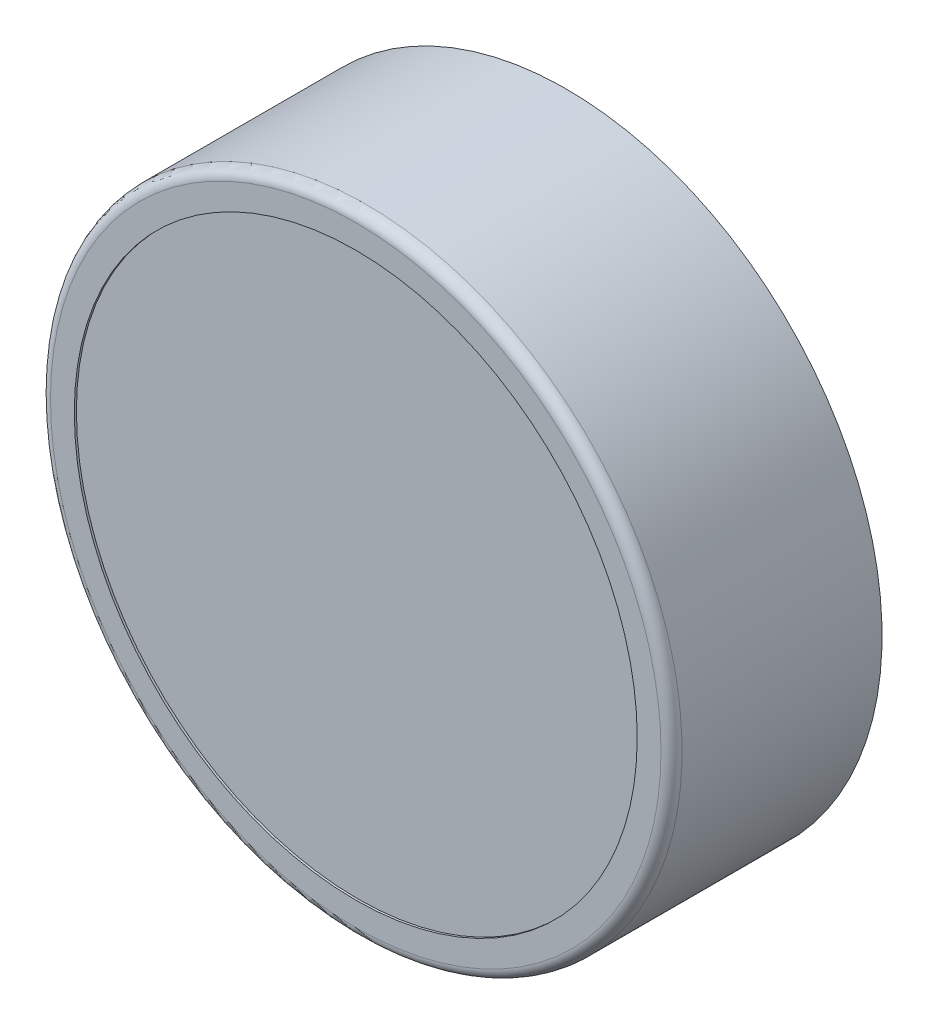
ISO-10303-21;
HEADER;
FILE_DESCRIPTION(('STEP AP214'),'2;1');
FILE_NAME('part.step','',(''),(''),'','','');
FILE_SCHEMA(('AUTOMOTIVE_DESIGN { 1 0 10303 214 1 1 1 1 }'));
ENDSEC;
DATA;
#1=APPLICATION_CONTEXT('core data for automotive mechanical design processes');
#2=APPLICATION_PROTOCOL_DEFINITION('international standard','automotive_design',2000,#1);
#3=PRODUCT_CONTEXT('',#1,'mechanical');
#4=PRODUCT('Part','Part','',(#3));
#5=PRODUCT_RELATED_PRODUCT_CATEGORY('part','',(#4));
#6=PRODUCT_DEFINITION_FORMATION('','',#4);
#7=PRODUCT_DEFINITION_CONTEXT('part definition',#1,'design');
#8=PRODUCT_DEFINITION('design','',#6,#7);
#9=PRODUCT_DEFINITION_SHAPE('','',#8);
#10=(LENGTH_UNIT() NAMED_UNIT(*) SI_UNIT(.MILLI.,.METRE.));
#11=(NAMED_UNIT(*) PLANE_ANGLE_UNIT() SI_UNIT($,.RADIAN.));
#12=(NAMED_UNIT(*) SI_UNIT($,.STERADIAN.) SOLID_ANGLE_UNIT());
#13=UNCERTAINTY_MEASURE_WITH_UNIT(LENGTH_MEASURE(1.E-05),#10,'distance_accuracy_value','');
#14=(GEOMETRIC_REPRESENTATION_CONTEXT(3) GLOBAL_UNCERTAINTY_ASSIGNED_CONTEXT((#13)) GLOBAL_UNIT_ASSIGNED_CONTEXT((#10,
#11,#12)) REPRESENTATION_CONTEXT('',''));
#15=CARTESIAN_POINT('',(0.,0.,0.));
#16=DIRECTION('',(0.,0.,1.));
#17=DIRECTION('',(1.,0.,0.));
#18=AXIS2_PLACEMENT_3D('',#15,#16,#17);
#19=CARTESIAN_POINT('',(0.,0.,9.9));
#20=DIRECTION('',(0.,0.,1.));
#21=DIRECTION('',(1.,0.,0.));
#22=AXIS2_PLACEMENT_3D('',#19,#20,#21);
#23=PLANE('',#22);
#24=CARTESIAN_POINT('',(0.,0.,9.9));
#25=DIRECTION('',(0.,0.,1.));
#26=DIRECTION('',(1.,0.,0.));
#27=AXIS2_PLACEMENT_3D('',#24,#25,#26);
#28=CIRCLE('',#27,13.3691624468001);
#29=CARTESIAN_POINT('',(13.3691624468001,0.,9.9));
#30=VERTEX_POINT('',#29);
#31=EDGE_CURVE('E166',#30,#30,#28,.T.);
#32=ORIENTED_EDGE('',*,*,#31,.T.);
#33=EDGE_LOOP('',(#32));
#34=FACE_BOUND('',#33,.T.);
#35=ADVANCED_FACE('F17',(#34),#23,.T.);
#36=CARTESIAN_POINT('',(0.,0.,9.9));
#37=DIRECTION('',(0.,0.,1.));
#38=DIRECTION('',(1.,0.,0.));
#39=AXIS2_PLACEMENT_3D('',#36,#37,#38);
#40=CYLINDRICAL_SURFACE('',#39,13.3691624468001);
#41=CARTESIAN_POINT('',(0.,0.,10.));
#42=DIRECTION('',(0.,0.,1.));
#43=DIRECTION('',(1.,0.,0.));
#44=AXIS2_PLACEMENT_3D('',#41,#42,#43);
#45=CIRCLE('',#44,13.3691624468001);
#46=CARTESIAN_POINT('',(13.3691624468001,0.,10.));
#47=VERTEX_POINT('',#46);
#48=EDGE_CURVE('E41',#47,#47,#45,.F.);
#49=ORIENTED_EDGE('',*,*,#48,.F.);
#50=EDGE_LOOP('',(#49));
#51=FACE_BOUND('',#50,.T.);
#52=ORIENTED_EDGE('',*,*,#31,.F.);
#53=EDGE_LOOP('',(#52));
#54=FACE_BOUND('',#53,.T.);
#55=ADVANCED_FACE('F97',(#51,#54),#40,.F.);
#56=CARTESIAN_POINT('',(0.,0.,10.));
#57=DIRECTION('',(0.,0.,1.));
#58=DIRECTION('',(1.,0.,0.));
#59=AXIS2_PLACEMENT_3D('',#56,#57,#58);
#60=PLANE('',#59);
#61=ORIENTED_EDGE('',*,*,#48,.T.);
#62=EDGE_LOOP('',(#61));
#63=FACE_BOUND('',#62,.T.);
#64=CARTESIAN_POINT('',(0.,0.,10.));
#65=DIRECTION('',(0.,0.,-1.));
#66=DIRECTION('',(-1.,0.,0.));
#67=AXIS2_PLACEMENT_3D('',#64,#65,#66);
#68=CIRCLE('',#67,14.5);
#69=CARTESIAN_POINT('',(-14.5,0.,10.));
#70=VERTEX_POINT('',#69);
#71=CARTESIAN_POINT('',(14.5,0.,10.));
#72=VERTEX_POINT('',#71);
#73=EDGE_CURVE('E34',#70,#72,#68,.T.);
#74=ORIENTED_EDGE('',*,*,#73,.F.);
#75=CARTESIAN_POINT('',(0.,0.,10.));
#76=DIRECTION('',(0.,0.,-1.));
#77=DIRECTION('',(1.,0.,0.));
#78=AXIS2_PLACEMENT_3D('',#75,#76,#77);
#79=CIRCLE('',#78,14.5);
#80=EDGE_CURVE('E39',#72,#70,#79,.T.);
#81=ORIENTED_EDGE('',*,*,#80,.F.);
#82=EDGE_LOOP('',(#74,#81));
#83=FACE_BOUND('',#82,.T.);
#84=ADVANCED_FACE('F38',(#63,#83),#60,.T.);
#85=CARTESIAN_POINT('',(0.,0.,9.5));
#86=DIRECTION('',(0.,0.,1.));
#87=DIRECTION('',(1.,0.,0.));
#88=AXIS2_PLACEMENT_3D('',#85,#86,#87);
#89=TOROIDAL_SURFACE('',#88,14.5,0.5);
#90=CARTESIAN_POINT('',(0.,0.,9.5));
#91=DIRECTION('',(0.,0.,-1.));
#92=DIRECTION('',(-1.,0.,0.));
#93=AXIS2_PLACEMENT_3D('',#90,#91,#92);
#94=CIRCLE('',#93,15.);
#95=CARTESIAN_POINT('',(-15.,0.,9.5));
#96=VERTEX_POINT('',#95);
#97=EDGE_CURVE('E28',#96,#96,#94,.T.);
#98=ORIENTED_EDGE('',*,*,#97,.F.);
#99=EDGE_LOOP('',(#98));
#100=FACE_BOUND('',#99,.T.);
#101=ORIENTED_EDGE('',*,*,#80,.T.);
#102=ORIENTED_EDGE('',*,*,#73,.T.);
#103=EDGE_LOOP('',(#101,#102));
#104=FACE_BOUND('',#103,.T.);
#105=ADVANCED_FACE('F45',(#100,#104),#89,.T.);
#106=CARTESIAN_POINT('',(0.,0.,10.));
#107=DIRECTION('',(0.,0.,-1.));
#108=DIRECTION('',(-1.,0.,0.));
#109=AXIS2_PLACEMENT_3D('',#106,#107,#108);
#110=CYLINDRICAL_SURFACE('',#109,15.);
#111=ORIENTED_EDGE('',*,*,#97,.T.);
#112=EDGE_LOOP('',(#111));
#113=FACE_BOUND('',#112,.T.);
#114=CARTESIAN_POINT('',(0.,0.,0.));
#115=DIRECTION('',(0.,0.,-1.));
#116=DIRECTION('',(-1.,0.,0.));
#117=AXIS2_PLACEMENT_3D('',#114,#115,#116);
#118=CIRCLE('',#117,15.);
#119=CARTESIAN_POINT('',(-15.,0.,0.));
#120=VERTEX_POINT('',#119);
#121=EDGE_CURVE('E11',#120,#120,#118,.F.);
#122=ORIENTED_EDGE('',*,*,#121,.T.);
#123=EDGE_LOOP('',(#122));
#124=FACE_BOUND('',#123,.T.);
#125=ADVANCED_FACE('F62',(#113,#124),#110,.T.);
#126=CARTESIAN_POINT('',(0.,0.,0.));
#127=DIRECTION('',(0.,0.,1.));
#128=DIRECTION('',(1.,0.,0.));
#129=AXIS2_PLACEMENT_3D('',#126,#127,#128);
#130=PLANE('',#129);
#131=ORIENTED_EDGE('',*,*,#121,.F.);
#132=EDGE_LOOP('',(#131));
#133=FACE_BOUND('',#132,.T.);
#134=ADVANCED_FACE('F74',(#133),#130,.F.);
#135=CLOSED_SHELL('',(#35,#55,#84,#105,#125,#134));
#136=MANIFOLD_SOLID_BREP('B1',#135);
#137=ADVANCED_BREP_SHAPE_REPRESENTATION('',(#18,#136),#14);
#138=SHAPE_DEFINITION_REPRESENTATION(#9,#137);
ENDSEC;
END-ISO-10303-21;
